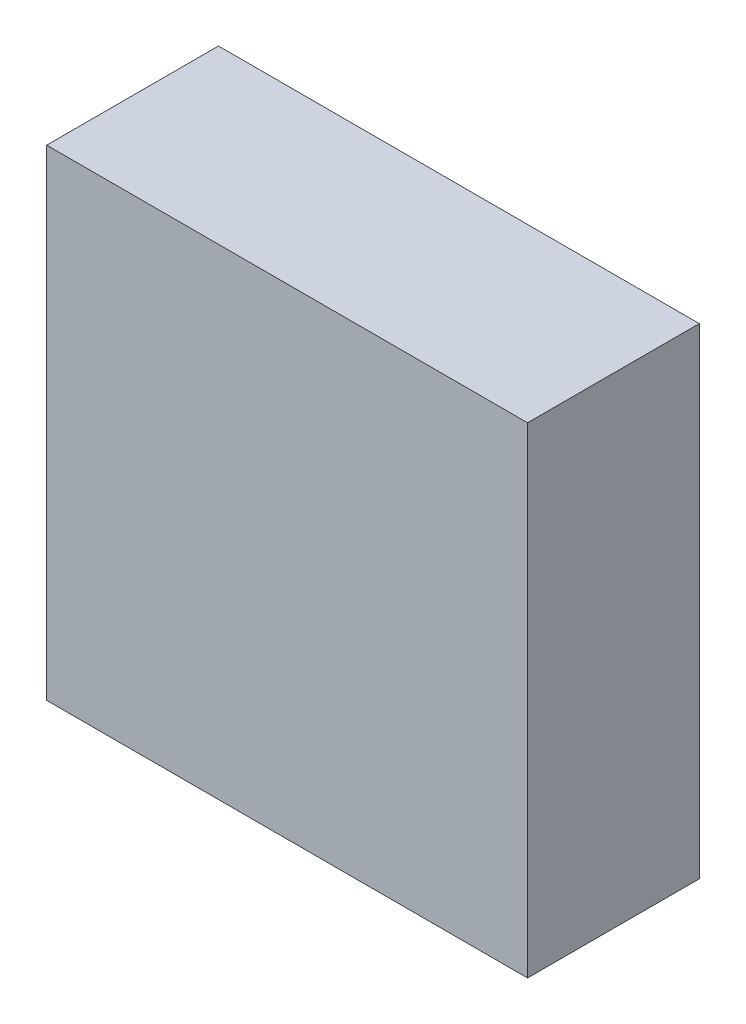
from build123d import *

# Parameters (mm, degrees)
ESQUISSE1_W        = 70
ESQUISSE1_H        = 70
BOSS_EXTRU_1_DEPTH = 25


with BuildPart() as part:
    # Esquisse1 → Boss.-Extru.1 (new body)
    with BuildSketch(Plane.XY):
        Rectangle(ESQUISSE1_W, ESQUISSE1_H)
    extrude(amount=BOSS_EXTRU_1_DEPTH)


solid = part.part
